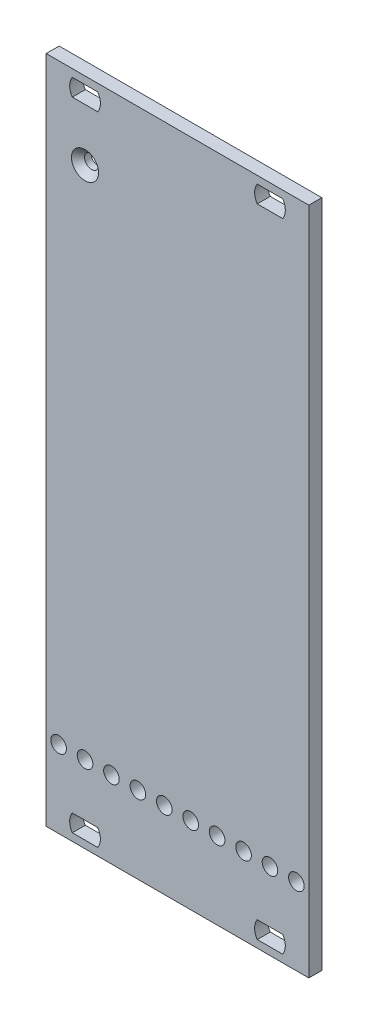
from build123d import *

# Parameters (mm, degrees)
SKETCH_1_W          = 50.5
SKETCH_1_H          = 128.7
EXTRUDE_1_DEPTH     = 2.5
CUT_EXTRUDE_2_REACH = 71.172
SKETCH_3_R          = 1.5
SKETCH_3_R_2        = 1.35
CHAMFER_3_SIZE      = 1.25


with BuildPart() as part:
    # Sketch 1 → Extrude 1 (new body)
    with BuildSketch(Plane.XY):
        Rectangle(SKETCH_1_W, SKETCH_1_H)
    extrude(amount=-EXTRUDE_1_DEPTH)

    # Sketch 3 → Cut-Extrude 2 (cut, up to next)
    with BuildSketch(Plane.XY, mode=Mode.PRIVATE) as cut_extrude_2_sk1:
        with Locations((-17.78, -49.5)):
            Circle(SKETCH_3_R)
    cut_extrude_2_tool1 = extrude(cut_extrude_2_sk1.sketch, amount=-CUT_EXTRUDE_2_REACH, mode=Mode.PRIVATE) & part.part
    # Sketch 3 → Cut-Extrude 2 (cut, up to next)
    with BuildSketch(Plane.XY, mode=Mode.PRIVATE) as cut_extrude_2_sk2:
        with Locations((-22.86, -49.5)):
            Circle(SKETCH_3_R)
    cut_extrude_2_tool2 = extrude(cut_extrude_2_sk2.sketch, amount=-CUT_EXTRUDE_2_REACH, mode=Mode.PRIVATE) & part.part
    # Sketch 3 → Cut-Extrude 2 (cut, up to next)
    with BuildSketch(Plane.XY, mode=Mode.PRIVATE) as cut_extrude_2_sk3:
        with Locations((-12.7, -49.5)):
            Circle(SKETCH_3_R)
    cut_extrude_2_tool3 = extrude(cut_extrude_2_sk3.sketch, amount=-CUT_EXTRUDE_2_REACH, mode=Mode.PRIVATE) & part.part
    # Sketch 3 → Cut-Extrude 2 (cut, up to next)
    with BuildSketch(Plane.XY, mode=Mode.PRIVATE) as cut_extrude_2_sk4:
        with Locations((12.7, -49.5)):
            Circle(SKETCH_3_R)
    cut_extrude_2_tool4 = extrude(cut_extrude_2_sk4.sketch, amount=-CUT_EXTRUDE_2_REACH, mode=Mode.PRIVATE) & part.part
    # Sketch 3 → Cut-Extrude 2 (cut, up to next)
    with BuildSketch(Plane.XY, mode=Mode.PRIVATE) as cut_extrude_2_sk5:
        with Locations((22.86, -49.5)):
            Circle(SKETCH_3_R)
    cut_extrude_2_tool5 = extrude(cut_extrude_2_sk5.sketch, amount=-CUT_EXTRUDE_2_REACH, mode=Mode.PRIVATE) & part.part
    # Sketch 3 → Cut-Extrude 2 (cut, up to next)
    with BuildSketch(Plane.XY, mode=Mode.PRIVATE) as cut_extrude_2_sk6:
        with Locations((17.78, -49.5)):
            Circle(SKETCH_3_R)
    cut_extrude_2_tool6 = extrude(cut_extrude_2_sk6.sketch, amount=-CUT_EXTRUDE_2_REACH, mode=Mode.PRIVATE) & part.part
    # Sketch 3 → Cut-Extrude 2 (cut, up to next)
    with BuildSketch(Plane.XY, mode=Mode.PRIVATE) as cut_extrude_2_sk7:
        with Locations((-2.54, -49.5)):
            Circle(SKETCH_3_R)
    cut_extrude_2_tool7 = extrude(cut_extrude_2_sk7.sketch, amount=-CUT_EXTRUDE_2_REACH, mode=Mode.PRIVATE) & part.part
    # Sketch 3 → Cut-Extrude 2 (cut, up to next)
    with BuildSketch(Plane.XY, mode=Mode.PRIVATE) as cut_extrude_2_sk8:
        with Locations((-7.62, -49.5)):
            Circle(SKETCH_3_R)
    cut_extrude_2_tool8 = extrude(cut_extrude_2_sk8.sketch, amount=-CUT_EXTRUDE_2_REACH, mode=Mode.PRIVATE) & part.part
    # Sketch 3 → Cut-Extrude 2 (cut, up to next)
    with BuildSketch(Plane.XY, mode=Mode.PRIVATE) as cut_extrude_2_sk9:
        with Locations((7.62, -49.5)):
            Circle(SKETCH_3_R)
    cut_extrude_2_tool9 = extrude(cut_extrude_2_sk9.sketch, amount=-CUT_EXTRUDE_2_REACH, mode=Mode.PRIVATE) & part.part
    # Sketch 3 → Cut-Extrude 2 (cut, up to next)
    with BuildSketch(Plane.XY, mode=Mode.PRIVATE) as cut_extrude_2_sk10:
        with Locations((2.54, -49.5)):
            Circle(SKETCH_3_R)
    cut_extrude_2_tool10 = extrude(cut_extrude_2_sk10.sketch, amount=-CUT_EXTRUDE_2_REACH, mode=Mode.PRIVATE) & part.part
    # Sketch 3 → Cut-Extrude 2 (cut, up to next)
    with BuildSketch(Plane.XY, mode=Mode.PRIVATE) as cut_extrude_2_sk11:
        with Locations((-17.78, 49.5)):
            Circle(SKETCH_3_R_2)
    cut_extrude_2_tool11 = extrude(cut_extrude_2_sk11.sketch, amount=-CUT_EXTRUDE_2_REACH, mode=Mode.PRIVATE) & part.part
    # Sketch 3 → Cut-Extrude 2 (cut, up to next)
    with BuildSketch(Plane.XY, mode=Mode.PRIVATE) as cut_extrude_2_sk12:
        with BuildLine():
            Line((-20.225403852, 62.9), (-15.334596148, 62.9))
            ThreePointArc((-15.334596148, 62.9), (-14.83, 61.25), (-15.334596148, 59.6))
            Line((-15.334596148, 59.6), (-20.225403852, 59.6))
            ThreePointArc((-20.225403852, 59.6), (-20.73, 61.25), (-20.225403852, 62.9))
        make_face()
    cut_extrude_2_tool12 = extrude(cut_extrude_2_sk12.sketch, amount=-CUT_EXTRUDE_2_REACH, mode=Mode.PRIVATE) & part.part
    # Sketch 3 → Cut-Extrude 2 (cut, up to next)
    with BuildSketch(Plane.XY, mode=Mode.PRIVATE) as cut_extrude_2_sk13:
        with BuildLine():
            Line((20.225403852, 59.6), (15.334596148, 59.6))
            ThreePointArc((15.334596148, 59.6), (14.83, 61.25), (15.334596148, 62.9))
            Line((15.334596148, 62.9), (20.225403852, 62.9))
            ThreePointArc((20.225403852, 62.9), (20.73, 61.25), (20.225403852, 59.6))
        make_face()
    cut_extrude_2_tool13 = extrude(cut_extrude_2_sk13.sketch, amount=-CUT_EXTRUDE_2_REACH, mode=Mode.PRIVATE) & part.part
    # Sketch 3 → Cut-Extrude 2 (cut, up to next)
    with BuildSketch(Plane.XY, mode=Mode.PRIVATE) as cut_extrude_2_sk14:
        with BuildLine():
            Line((20.225403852, -62.9), (15.334596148, -62.9))
            ThreePointArc((15.334596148, -62.9), (14.83, -61.25), (15.334596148, -59.6))
            Line((15.334596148, -59.6), (20.225403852, -59.6))
            ThreePointArc((20.225403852, -59.6), (20.73, -61.25), (20.225403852, -62.9))
        make_face()
    cut_extrude_2_tool14 = extrude(cut_extrude_2_sk14.sketch, amount=-CUT_EXTRUDE_2_REACH, mode=Mode.PRIVATE) & part.part
    # Sketch 3 → Cut-Extrude 2 (cut, up to next)
    with BuildSketch(Plane.XY, mode=Mode.PRIVATE) as cut_extrude_2_sk15:
        with BuildLine():
            Line((-20.225403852, -59.6), (-15.334596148, -59.6))
            ThreePointArc((-15.334596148, -59.6), (-14.83, -61.25), (-15.334596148, -62.9))
            Line((-15.334596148, -62.9), (-20.225403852, -62.9))
            ThreePointArc((-20.225403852, -62.9), (-20.73, -61.25), (-20.225403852, -59.6))
        make_face()
    cut_extrude_2_tool15 = extrude(cut_extrude_2_sk15.sketch, amount=-CUT_EXTRUDE_2_REACH, mode=Mode.PRIVATE) & part.part
    add(cut_extrude_2_tool1.solids().sort_by_distance((-17.78, -49.5, 0))[0], mode=Mode.SUBTRACT)
    add(cut_extrude_2_tool2.solids().sort_by_distance((-22.86, -49.5, 0))[0], mode=Mode.SUBTRACT)
    add(cut_extrude_2_tool3.solids().sort_by_distance((-12.7, -49.5, 0))[0], mode=Mode.SUBTRACT)
    add(cut_extrude_2_tool4.solids().sort_by_distance((12.7, -49.5, 0))[0], mode=Mode.SUBTRACT)
    add(cut_extrude_2_tool5.solids().sort_by_distance((22.86, -49.5, 0))[0], mode=Mode.SUBTRACT)
    add(cut_extrude_2_tool6.solids().sort_by_distance((17.78, -49.5, 0))[0], mode=Mode.SUBTRACT)
    add(cut_extrude_2_tool7.solids().sort_by_distance((-2.54, -49.5, 0))[0], mode=Mode.SUBTRACT)
    add(cut_extrude_2_tool8.solids().sort_by_distance((-7.62, -49.5, 0))[0], mode=Mode.SUBTRACT)
    add(cut_extrude_2_tool9.solids().sort_by_distance((7.62, -49.5, 0))[0], mode=Mode.SUBTRACT)
    add(cut_extrude_2_tool10.solids().sort_by_distance((2.54, -49.5, 0))[0], mode=Mode.SUBTRACT)
    add(cut_extrude_2_tool11.solids().sort_by_distance((-17.78, 49.5, 0))[0], mode=Mode.SUBTRACT)
    add(cut_extrude_2_tool12.solids().sort_by_distance((-17.78, 61.25, 0))[0], mode=Mode.SUBTRACT)
    add(cut_extrude_2_tool13.solids().sort_by_distance((17.78, 61.25, 0))[0], mode=Mode.SUBTRACT)
    add(cut_extrude_2_tool14.solids().sort_by_distance((17.78, -61.25, 0))[0], mode=Mode.SUBTRACT)
    add(cut_extrude_2_tool15.solids().sort_by_distance((-17.78, -61.25, 0))[0], mode=Mode.SUBTRACT)

    # Chamfer 3
    chamfer_3_edges = [part.edges().sort_by_distance(p)[0] for p in [
        (-19.13, 49.5, 0),
    ]]
    chamfer(chamfer_3_edges, length=CHAMFER_3_SIZE)


solid = part.part
